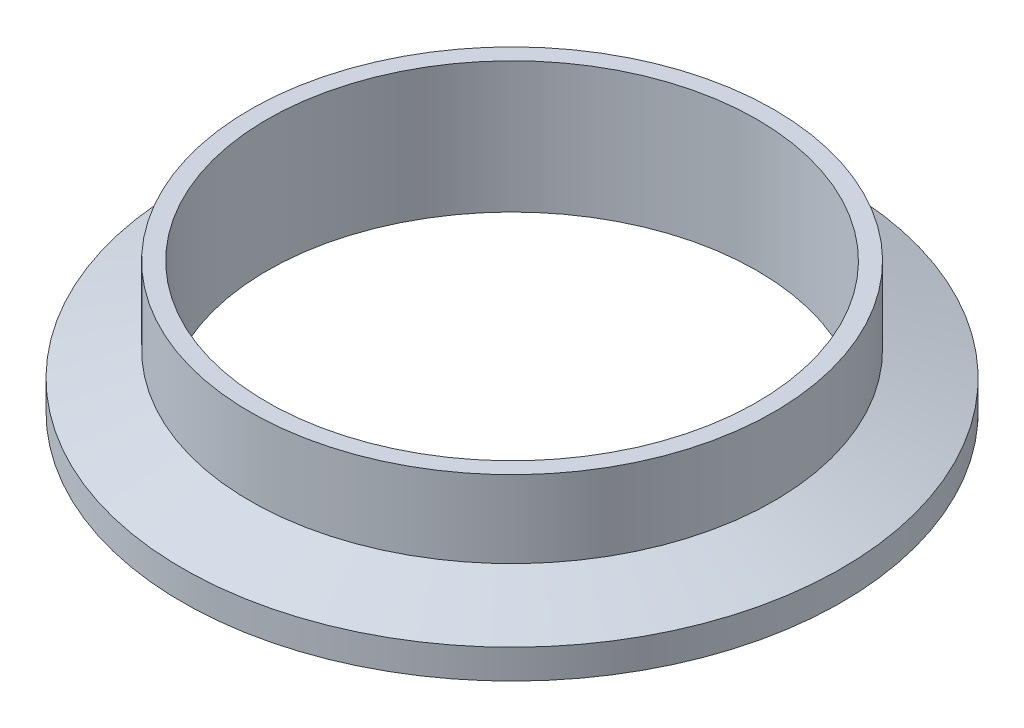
ISO-10303-21;
HEADER;
FILE_DESCRIPTION(('STEP AP214'),'2;1');
FILE_NAME('part.step','',(''),(''),'','','');
FILE_SCHEMA(('AUTOMOTIVE_DESIGN { 1 0 10303 214 1 1 1 1 }'));
ENDSEC;
DATA;
#1=APPLICATION_CONTEXT('core data for automotive mechanical design processes');
#2=APPLICATION_PROTOCOL_DEFINITION('international standard','automotive_design',2000,#1);
#3=PRODUCT_CONTEXT('',#1,'mechanical');
#4=PRODUCT('Part','Part','',(#3));
#5=PRODUCT_RELATED_PRODUCT_CATEGORY('part','',(#4));
#6=PRODUCT_DEFINITION_FORMATION('','',#4);
#7=PRODUCT_DEFINITION_CONTEXT('part definition',#1,'design');
#8=PRODUCT_DEFINITION('design','',#6,#7);
#9=PRODUCT_DEFINITION_SHAPE('','',#8);
#10=(LENGTH_UNIT() NAMED_UNIT(*) SI_UNIT(.MILLI.,.METRE.));
#11=(NAMED_UNIT(*) PLANE_ANGLE_UNIT() SI_UNIT($,.RADIAN.));
#12=(NAMED_UNIT(*) SI_UNIT($,.STERADIAN.) SOLID_ANGLE_UNIT());
#13=UNCERTAINTY_MEASURE_WITH_UNIT(LENGTH_MEASURE(1.E-05),#10,'distance_accuracy_value','');
#14=(GEOMETRIC_REPRESENTATION_CONTEXT(3) GLOBAL_UNCERTAINTY_ASSIGNED_CONTEXT((#13)) GLOBAL_UNIT_ASSIGNED_CONTEXT((#10,
#11,#12)) REPRESENTATION_CONTEXT('',''));
#15=CARTESIAN_POINT('',(0.,0.,0.));
#16=DIRECTION('',(0.,0.,1.));
#17=DIRECTION('',(1.,0.,0.));
#18=AXIS2_PLACEMENT_3D('',#15,#16,#17);
#19=CARTESIAN_POINT('',(0.,0.,0.));
#20=DIRECTION('',(0.,1.,0.));
#21=DIRECTION('',(0.,0.,1.));
#22=AXIS2_PLACEMENT_3D('',#19,#20,#21);
#23=PLANE('',#22);
#24=CARTESIAN_POINT('',(0.,0.,0.));
#25=DIRECTION('',(0.,-1.,0.));
#26=DIRECTION('',(0.,0.,-1.));
#27=AXIS2_PLACEMENT_3D('',#24,#25,#26);
#28=CIRCLE('',#27,30.1591722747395);
#29=CARTESIAN_POINT('',(0.,0.,-30.1591722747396));
#30=VERTEX_POINT('',#29);
#31=EDGE_CURVE('E10',#30,#30,#28,.T.);
#32=ORIENTED_EDGE('',*,*,#31,.F.);
#33=EDGE_LOOP('',(#32));
#34=FACE_BOUND('',#33,.T.);
#35=CARTESIAN_POINT('',(0.,0.,0.));
#36=DIRECTION('',(0.,-1.,0.));
#37=DIRECTION('',(0.,0.,-1.));
#38=AXIS2_PLACEMENT_3D('',#35,#36,#37);
#39=CIRCLE('',#38,31.9532);
#40=CARTESIAN_POINT('',(0.,0.,-31.9532000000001));
#41=VERTEX_POINT('',#40);
#42=EDGE_CURVE('E70',#41,#41,#39,.T.);
#43=ORIENTED_EDGE('',*,*,#42,.T.);
#44=EDGE_LOOP('',(#43));
#45=FACE_BOUND('',#44,.T.);
#46=ADVANCED_FACE('F30',(#34,#45),#23,.F.);
#47=CARTESIAN_POINT('',(0.,0.787399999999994,0.));
#48=DIRECTION('',(0.,-1.,0.));
#49=DIRECTION('',(0.,0.,-1.));
#50=AXIS2_PLACEMENT_3D('',#47,#48,#49);
#51=TOROIDAL_SURFACE('',#50,30.1591722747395,0.7874);
#52=CARTESIAN_POINT('',(0.,0.479738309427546,0.));
#53=DIRECTION('',(0.,-1.,0.));
#54=DIRECTION('',(0.,0.,-1.));
#55=AXIS2_PLACEMENT_3D('',#52,#53,#54);
#56=CIRCLE('',#55,29.4343667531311);
#57=CARTESIAN_POINT('',(0.,0.479738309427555,-29.4343667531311));
#58=VERTEX_POINT('',#57);
#59=EDGE_CURVE('E36',#58,#58,#56,.T.);
#60=ORIENTED_EDGE('',*,*,#59,.F.);
#61=EDGE_LOOP('',(#60));
#62=FACE_BOUND('',#61,.T.);
#63=ORIENTED_EDGE('',*,*,#31,.T.);
#64=EDGE_LOOP('',(#63));
#65=FACE_BOUND('',#64,.T.);
#66=ADVANCED_FACE('F111',(#62,#65),#51,.T.);
#67=CARTESIAN_POINT('',(0.,0.872854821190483,0.));
#68=DIRECTION('',(0.,-1.,0.));
#69=DIRECTION('',(0.,0.,-1.));
#70=AXIS2_PLACEMENT_3D('',#67,#68,#69);
#71=CONICAL_SURFACE('',#70,29.2674986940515,0.401425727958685);
#72=ORIENTED_EDGE('',*,*,#59,.T.);
#73=EDGE_LOOP('',(#72));
#74=FACE_BOUND('',#73,.T.);
#75=CARTESIAN_POINT('',(0.,0.872854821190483,0.));
#76=DIRECTION('',(0.,-1.,0.));
#77=DIRECTION('',(0.,0.,-1.));
#78=AXIS2_PLACEMENT_3D('',#75,#76,#77);
#79=CIRCLE('',#78,29.2674986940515);
#80=CARTESIAN_POINT('',(0.,0.872854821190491,-29.2674986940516));
#81=VERTEX_POINT('',#80);
#82=EDGE_CURVE('E40',#81,#81,#79,.T.);
#83=ORIENTED_EDGE('',*,*,#82,.F.);
#84=EDGE_LOOP('',(#83));
#85=FACE_BOUND('',#84,.T.);
#86=ADVANCED_FACE('F116',(#74,#85),#71,.F.);
#87=CARTESIAN_POINT('',(0.,0.406399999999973,0.));
#88=DIRECTION('',(0.,-1.,0.));
#89=DIRECTION('',(0.,0.,-1.));
#90=AXIS2_PLACEMENT_3D('',#87,#88,#89);
#91=TOROIDAL_SURFACE('',#90,28.1686,1.1938);
#92=CARTESIAN_POINT('',(0.,0.872854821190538,0.));
#93=DIRECTION('',(0.,-1.,0.));
#94=DIRECTION('',(0.,0.,-1.));
#95=AXIS2_PLACEMENT_3D('',#92,#93,#94);
#96=CIRCLE('',#95,27.0697013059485);
#97=CARTESIAN_POINT('',(0.,0.872854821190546,-27.0697013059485));
#98=VERTEX_POINT('',#97);
#99=EDGE_CURVE('E44',#98,#98,#96,.T.);
#100=ORIENTED_EDGE('',*,*,#99,.F.);
#101=EDGE_LOOP('',(#100));
#102=FACE_BOUND('',#101,.T.);
#103=ORIENTED_EDGE('',*,*,#82,.T.);
#104=EDGE_LOOP('',(#103));
#105=FACE_BOUND('',#104,.T.);
#106=ADVANCED_FACE('F121',(#102,#105),#91,.F.);
#107=CARTESIAN_POINT('',(0.,0.872854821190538,0.));
#108=DIRECTION('',(0.,1.,0.));
#109=DIRECTION('',(0.,0.,1.));
#110=AXIS2_PLACEMENT_3D('',#107,#108,#109);
#111=CONICAL_SURFACE('',#110,27.0697013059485,0.401425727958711);
#112=CARTESIAN_POINT('',(0.,0.479738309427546,0.));
#113=DIRECTION('',(0.,-1.,0.));
#114=DIRECTION('',(0.,0.,-1.));
#115=AXIS2_PLACEMENT_3D('',#112,#113,#114);
#116=CIRCLE('',#115,26.9028332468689);
#117=CARTESIAN_POINT('',(0.,0.479738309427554,-26.902833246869));
#118=VERTEX_POINT('',#117);
#119=EDGE_CURVE('E49',#118,#118,#116,.T.);
#120=ORIENTED_EDGE('',*,*,#119,.F.);
#121=EDGE_LOOP('',(#120));
#122=FACE_BOUND('',#121,.T.);
#123=ORIENTED_EDGE('',*,*,#99,.T.);
#124=EDGE_LOOP('',(#123));
#125=FACE_BOUND('',#124,.T.);
#126=ADVANCED_FACE('F126',(#122,#125),#111,.T.);
#127=CARTESIAN_POINT('',(0.,0.787399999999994,0.));
#128=DIRECTION('',(0.,-1.,0.));
#129=DIRECTION('',(0.,0.,-1.));
#130=AXIS2_PLACEMENT_3D('',#127,#128,#129);
#131=TOROIDAL_SURFACE('',#130,26.1780277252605,0.787399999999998);
#132=ORIENTED_EDGE('',*,*,#119,.T.);
#133=EDGE_LOOP('',(#132));
#134=FACE_BOUND('',#133,.T.);
#135=CARTESIAN_POINT('',(0.,0.,0.));
#136=DIRECTION('',(0.,-1.,0.));
#137=DIRECTION('',(0.,0.,-1.));
#138=AXIS2_PLACEMENT_3D('',#135,#136,#137);
#139=CIRCLE('',#138,26.1780277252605);
#140=CARTESIAN_POINT('',(0.,0.,-26.1780277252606));
#141=VERTEX_POINT('',#140);
#142=EDGE_CURVE('E52',#141,#141,#139,.T.);
#143=ORIENTED_EDGE('',*,*,#142,.F.);
#144=EDGE_LOOP('',(#143));
#145=FACE_BOUND('',#144,.T.);
#146=ADVANCED_FACE('F107',(#134,#145),#131,.T.);
#147=CARTESIAN_POINT('',(0.,0.,0.));
#148=DIRECTION('',(0.,1.,0.));
#149=DIRECTION('',(0.,0.,1.));
#150=AXIS2_PLACEMENT_3D('',#147,#148,#149);
#151=PLANE('',#150);
#152=CARTESIAN_POINT('',(0.,0.,0.));
#153=DIRECTION('',(0.,-1.,0.));
#154=DIRECTION('',(0.,0.,-1.));
#155=AXIS2_PLACEMENT_3D('',#152,#153,#154);
#156=CIRCLE('',#155,23.749);
#157=CARTESIAN_POINT('',(0.,0.,-23.7490000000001));
#158=VERTEX_POINT('',#157);
#159=EDGE_CURVE('E55',#158,#158,#156,.T.);
#160=ORIENTED_EDGE('',*,*,#159,.F.);
#161=EDGE_LOOP('',(#160));
#162=FACE_BOUND('',#161,.T.);
#163=ORIENTED_EDGE('',*,*,#142,.T.);
#164=EDGE_LOOP('',(#163));
#165=FACE_BOUND('',#164,.T.);
#166=ADVANCED_FACE('F101',(#162,#165),#151,.F.);
#167=CARTESIAN_POINT('',(0.,0.,0.));
#168=DIRECTION('',(0.,-1.,0.));
#169=DIRECTION('',(0.,0.,-1.));
#170=AXIS2_PLACEMENT_3D('',#167,#168,#169);
#171=CYLINDRICAL_SURFACE('',#170,23.749);
#172=ORIENTED_EDGE('',*,*,#159,.T.);
#173=EDGE_LOOP('',(#172));
#174=FACE_BOUND('',#173,.T.);
#175=CARTESIAN_POINT('',(-1.38777878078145E-13,12.7,0.));
#176=DIRECTION('',(0.,-1.,0.));
#177=DIRECTION('',(0.,0.,-1.));
#178=AXIS2_PLACEMENT_3D('',#175,#176,#177);
#179=CIRCLE('',#178,23.749);
#180=CARTESIAN_POINT('',(-1.49324552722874E-13,12.7,-23.7490000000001));
#181=VERTEX_POINT('',#180);
#182=EDGE_CURVE('E58',#181,#181,#179,.T.);
#183=ORIENTED_EDGE('',*,*,#182,.F.);
#184=EDGE_LOOP('',(#183));
#185=FACE_BOUND('',#184,.T.);
#186=ADVANCED_FACE('F96',(#174,#185),#171,.F.);
#187=CARTESIAN_POINT('',(-1.38777878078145E-13,12.7,0.));
#188=DIRECTION('',(0.,-1.,0.));
#189=DIRECTION('',(0.,0.,-1.));
#190=AXIS2_PLACEMENT_3D('',#187,#188,#189);
#191=PLANE('',#190);
#192=CARTESIAN_POINT('',(-1.38777878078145E-13,12.7,0.));
#193=DIRECTION('',(0.,-1.,0.));
#194=DIRECTION('',(0.,0.,-1.));
#195=AXIS2_PLACEMENT_3D('',#192,#193,#194);
#196=CIRCLE('',#195,25.4);
#197=CARTESIAN_POINT('',(-1.50057744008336E-13,12.7,-25.4000000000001));
#198=VERTEX_POINT('',#197);
#199=EDGE_CURVE('E61',#198,#198,#196,.T.);
#200=ORIENTED_EDGE('',*,*,#199,.F.);
#201=EDGE_LOOP('',(#200));
#202=FACE_BOUND('',#201,.T.);
#203=ORIENTED_EDGE('',*,*,#182,.T.);
#204=EDGE_LOOP('',(#203));
#205=FACE_BOUND('',#204,.T.);
#206=ADVANCED_FACE('F90',(#202,#205),#191,.F.);
#207=CARTESIAN_POINT('',(0.,0.,0.));
#208=DIRECTION('',(0.,-1.,0.));
#209=DIRECTION('',(0.,0.,-1.));
#210=AXIS2_PLACEMENT_3D('',#207,#208,#209);
#211=CYLINDRICAL_SURFACE('',#210,25.4);
#212=CARTESIAN_POINT('',(-1.66533453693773E-13,5.22996973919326,0.));
#213=DIRECTION('',(0.,-1.,0.));
#214=DIRECTION('',(0.,0.,-1.));
#215=AXIS2_PLACEMENT_3D('',#212,#213,#214);
#216=CIRCLE('',#215,25.4);
#217=CARTESIAN_POINT('',(-1.77813319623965E-13,5.22996973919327,-25.4000000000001));
#218=VERTEX_POINT('',#217);
#219=EDGE_CURVE('E64',#218,#218,#216,.T.);
#220=ORIENTED_EDGE('',*,*,#219,.F.);
#221=EDGE_LOOP('',(#220));
#222=FACE_BOUND('',#221,.T.);
#223=ORIENTED_EDGE('',*,*,#199,.T.);
#224=EDGE_LOOP('',(#223));
#225=FACE_BOUND('',#224,.T.);
#226=ADVANCED_FACE('F84',(#222,#225),#211,.T.);
#227=CARTESIAN_POINT('',(-1.66533453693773E-13,5.22996973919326,0.));
#228=DIRECTION('',(0.,-1.,0.));
#229=DIRECTION('',(0.,0.,-1.));
#230=AXIS2_PLACEMENT_3D('',#227,#228,#229);
#231=CONICAL_SURFACE('',#230,25.4,1.22173047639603);
#232=CARTESIAN_POINT('',(-1.38777878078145E-13,2.84480000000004,0.));
#233=DIRECTION('',(0.,-1.,0.));
#234=DIRECTION('',(0.,0.,-1.));
#235=AXIS2_PLACEMENT_3D('',#232,#233,#234);
#236=CIRCLE('',#235,31.9532);
#237=CARTESIAN_POINT('',(-1.52967949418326E-13,2.84480000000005,-31.9532000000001));
#238=VERTEX_POINT('',#237);
#239=EDGE_CURVE('E67',#238,#238,#236,.T.);
#240=ORIENTED_EDGE('',*,*,#239,.F.);
#241=EDGE_LOOP('',(#240));
#242=FACE_BOUND('',#241,.T.);
#243=ORIENTED_EDGE('',*,*,#219,.T.);
#244=EDGE_LOOP('',(#243));
#245=FACE_BOUND('',#244,.T.);
#246=ADVANCED_FACE('F78',(#242,#245),#231,.T.);
#247=CARTESIAN_POINT('',(0.,0.,0.));
#248=DIRECTION('',(0.,-1.,0.));
#249=DIRECTION('',(0.,0.,-1.));
#250=AXIS2_PLACEMENT_3D('',#247,#248,#249);
#251=CYLINDRICAL_SURFACE('',#250,31.9532);
#252=ORIENTED_EDGE('',*,*,#42,.F.);
#253=EDGE_LOOP('',(#252));
#254=FACE_BOUND('',#253,.T.);
#255=ORIENTED_EDGE('',*,*,#239,.T.);
#256=EDGE_LOOP('',(#255));
#257=FACE_BOUND('',#256,.T.);
#258=ADVANCED_FACE('F75',(#254,#257),#251,.T.);
#259=CLOSED_SHELL('',(#46,#66,#86,#106,#126,#146,#166,#186,#206,#226,#246,#258));
#260=MANIFOLD_SOLID_BREP('B2',#259);
#261=ADVANCED_BREP_SHAPE_REPRESENTATION('',(#18,#260),#14);
#262=SHAPE_DEFINITION_REPRESENTATION(#9,#261);
ENDSEC;
END-ISO-10303-21;
